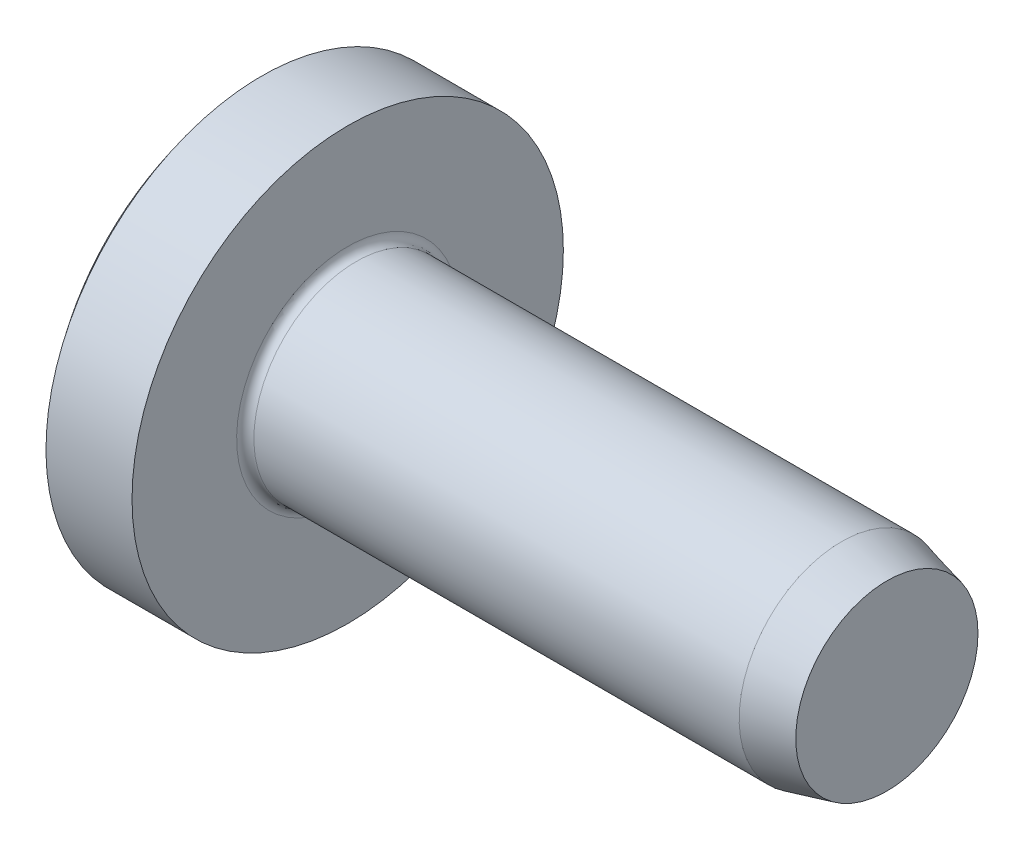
ISO-10303-21;
HEADER;
FILE_DESCRIPTION(('STEP AP214'),'2;1');
FILE_NAME('part.step','',(''),(''),'','','');
FILE_SCHEMA(('AUTOMOTIVE_DESIGN { 1 0 10303 214 1 1 1 1 }'));
ENDSEC;
DATA;
#1=APPLICATION_CONTEXT('core data for automotive mechanical design processes');
#2=APPLICATION_PROTOCOL_DEFINITION('international standard','automotive_design',2000,#1);
#3=PRODUCT_CONTEXT('',#1,'mechanical');
#4=PRODUCT('Part','Part','',(#3));
#5=PRODUCT_RELATED_PRODUCT_CATEGORY('part','',(#4));
#6=PRODUCT_DEFINITION_FORMATION('','',#4);
#7=PRODUCT_DEFINITION_CONTEXT('part definition',#1,'design');
#8=PRODUCT_DEFINITION('design','',#6,#7);
#9=PRODUCT_DEFINITION_SHAPE('','',#8);
#10=(LENGTH_UNIT() NAMED_UNIT(*) SI_UNIT(.MILLI.,.METRE.));
#11=(NAMED_UNIT(*) PLANE_ANGLE_UNIT() SI_UNIT($,.RADIAN.));
#12=(NAMED_UNIT(*) SI_UNIT($,.STERADIAN.) SOLID_ANGLE_UNIT());
#13=UNCERTAINTY_MEASURE_WITH_UNIT(LENGTH_MEASURE(1.E-05),#10,'distance_accuracy_value','');
#14=(GEOMETRIC_REPRESENTATION_CONTEXT(3) GLOBAL_UNCERTAINTY_ASSIGNED_CONTEXT((#13)) GLOBAL_UNIT_ASSIGNED_CONTEXT((#10,
#11,#12)) REPRESENTATION_CONTEXT('',''));
#15=CARTESIAN_POINT('',(0.,0.,0.));
#16=DIRECTION('',(0.,0.,1.));
#17=DIRECTION('',(1.,0.,0.));
#18=AXIS2_PLACEMENT_3D('',#15,#16,#17);
#19=CARTESIAN_POINT('',(-65.5475361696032,0.,0.));
#20=DIRECTION('',(-1.,0.,0.));
#21=DIRECTION('',(0.,-1.,0.));
#22=AXIS2_PLACEMENT_3D('',#19,#20,#21);
#23=CYLINDRICAL_SURFACE('',#22,4.75000000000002);
#24=CARTESIAN_POINT('',(30.4,0.,0.));
#25=DIRECTION('',(1.,0.,0.));
#26=DIRECTION('',(0.,0.,-1.));
#27=AXIS2_PLACEMENT_3D('',#24,#25,#26);
#28=CIRCLE('',#27,4.75);
#29=CARTESIAN_POINT('',(30.4,0.,-4.75));
#30=VERTEX_POINT('',#29);
#31=EDGE_CURVE('E252',#30,#30,#28,.T.);
#32=ORIENTED_EDGE('',*,*,#31,.F.);
#33=EDGE_LOOP('',(#32));
#34=FACE_BOUND('',#33,.T.);
#35=CARTESIAN_POINT('',(7.9,0.,0.));
#36=DIRECTION('',(-1.,0.,0.));
#37=DIRECTION('',(0.,-1.,0.));
#38=AXIS2_PLACEMENT_3D('',#35,#36,#37);
#39=CIRCLE('',#38,4.75000000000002);
#40=CARTESIAN_POINT('',(7.9,-4.75000000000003,0.));
#41=VERTEX_POINT('',#40);
#42=EDGE_CURVE('E12',#41,#41,#39,.F.);
#43=ORIENTED_EDGE('',*,*,#42,.T.);
#44=EDGE_LOOP('',(#43));
#45=FACE_BOUND('',#44,.T.);
#46=ADVANCED_FACE('F38',(#34,#45),#23,.T.);
#47=CARTESIAN_POINT('',(16.,0.,0.));
#48=DIRECTION('',(-1.,0.,0.));
#49=DIRECTION('',(0.,1.,0.));
#50=AXIS2_PLACEMENT_3D('',#47,#48,#49);
#51=SPHERICAL_SURFACE('',#50,16.);
#52=CARTESIAN_POINT('',(3.51000400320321,0.,0.));
#53=DIRECTION('',(-1.,0.,0.));
#54=DIRECTION('',(0.,-1.,0.));
#55=AXIS2_PLACEMENT_3D('',#52,#53,#54);
#56=CIRCLE('',#55,10.);
#57=CARTESIAN_POINT('',(3.51000400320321,-10.,0.));
#58=VERTEX_POINT('',#57);
#59=EDGE_CURVE('E208',#58,#58,#56,.T.);
#60=ORIENTED_EDGE('',*,*,#59,.T.);
#61=EDGE_LOOP('',(#60));
#62=FACE_BOUND('',#61,.T.);
#63=CARTESIAN_POINT('',(16.,0.,-1.01));
#64=DIRECTION('',(0.,0.,1.));
#65=DIRECTION('',(0.,-1.,0.));
#66=AXIS2_PLACEMENT_3D('',#63,#64,#65);
#67=CIRCLE('',#66,15.9680900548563);
#68=CARTESIAN_POINT('',(0.71931245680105,4.63470475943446,-1.01));
#69=VERTEX_POINT('',#68);
#70=CARTESIAN_POINT('',(0.0638837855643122,1.01,-1.01));
#71=VERTEX_POINT('',#70);
#72=EDGE_CURVE('E167',#69,#71,#67,.T.);
#73=ORIENTED_EDGE('',*,*,#72,.F.);
#74=CARTESIAN_POINT('',(14.1867141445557,-3.14070323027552,0.));
#75=DIRECTION('',(-0.500000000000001,-0.866025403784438,0.));
#76=DIRECTION('',(0.866025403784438,-0.500000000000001,0.));
#77=AXIS2_PLACEMENT_3D('',#74,#75,#76);
#78=CIRCLE('',#77,15.5835803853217);
#79=CARTESIAN_POINT('',(0.71931245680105,4.63470475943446,1.01));
#80=VERTEX_POINT('',#79);
#81=EDGE_CURVE('E197',#80,#69,#78,.T.);
#82=ORIENTED_EDGE('',*,*,#81,.F.);
#83=CARTESIAN_POINT('',(16.,0.,1.01));
#84=DIRECTION('',(0.,0.,-1.));
#85=DIRECTION('',(0.,1.,0.));
#86=AXIS2_PLACEMENT_3D('',#83,#84,#85);
#87=CIRCLE('',#86,15.9680900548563);
#88=CARTESIAN_POINT('',(0.0638837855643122,1.01,1.01));
#89=VERTEX_POINT('',#88);
#90=EDGE_CURVE('E171',#89,#80,#87,.T.);
#91=ORIENTED_EDGE('',*,*,#90,.F.);
#92=CARTESIAN_POINT('',(16.,1.01,0.));
#93=DIRECTION('',(0.,-1.,0.));
#94=DIRECTION('',(0.,0.,-1.));
#95=AXIS2_PLACEMENT_3D('',#92,#93,#94);
#96=CIRCLE('',#95,15.9680900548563);
#97=CARTESIAN_POINT('',(0.71931245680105,1.01,4.63470475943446));
#98=VERTEX_POINT('',#97);
#99=EDGE_CURVE('E163',#98,#89,#96,.T.);
#100=ORIENTED_EDGE('',*,*,#99,.F.);
#101=CARTESIAN_POINT('',(14.1867141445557,0.,-3.14070323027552));
#102=DIRECTION('',(-0.500000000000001,0.,-0.866025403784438));
#103=DIRECTION('',(-0.866025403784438,0.,0.500000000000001));
#104=AXIS2_PLACEMENT_3D('',#101,#102,#103);
#105=CIRCLE('',#104,15.5835803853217);
#106=CARTESIAN_POINT('',(0.71931245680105,-1.01,4.63470475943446));
#107=VERTEX_POINT('',#106);
#108=EDGE_CURVE('E161',#107,#98,#105,.T.);
#109=ORIENTED_EDGE('',*,*,#108,.F.);
#110=CARTESIAN_POINT('',(16.,-1.01,0.));
#111=DIRECTION('',(0.,1.,0.));
#112=DIRECTION('',(0.,0.,1.));
#113=AXIS2_PLACEMENT_3D('',#110,#111,#112);
#114=CIRCLE('',#113,15.9680900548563);
#115=CARTESIAN_POINT('',(0.0638837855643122,-1.01,1.01));
#116=VERTEX_POINT('',#115);
#117=EDGE_CURVE('E145',#116,#107,#114,.T.);
#118=ORIENTED_EDGE('',*,*,#117,.F.);
#119=CARTESIAN_POINT('',(16.,0.,1.01));
#120=DIRECTION('',(0.,0.,-1.));
#121=DIRECTION('',(0.,1.,0.));
#122=AXIS2_PLACEMENT_3D('',#119,#120,#121);
#123=CIRCLE('',#122,15.9680900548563);
#124=CARTESIAN_POINT('',(0.71931245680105,-4.63470475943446,1.01));
#125=VERTEX_POINT('',#124);
#126=EDGE_CURVE('E135',#125,#116,#123,.T.);
#127=ORIENTED_EDGE('',*,*,#126,.F.);
#128=CARTESIAN_POINT('',(14.1867141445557,3.14070323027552,0.));
#129=DIRECTION('',(-0.500000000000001,0.866025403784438,0.));
#130=DIRECTION('',(-0.866025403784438,-0.500000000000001,0.));
#131=AXIS2_PLACEMENT_3D('',#128,#129,#130);
#132=CIRCLE('',#131,15.5835803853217);
#133=CARTESIAN_POINT('',(0.71931245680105,-4.63470475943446,-1.01));
#134=VERTEX_POINT('',#133);
#135=EDGE_CURVE('E146',#134,#125,#132,.T.);
#136=ORIENTED_EDGE('',*,*,#135,.F.);
#137=CARTESIAN_POINT('',(16.,0.,-1.01));
#138=DIRECTION('',(0.,0.,1.));
#139=DIRECTION('',(0.,-1.,0.));
#140=AXIS2_PLACEMENT_3D('',#137,#138,#139);
#141=CIRCLE('',#140,15.9680900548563);
#142=CARTESIAN_POINT('',(0.0638837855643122,-1.01,-1.01));
#143=VERTEX_POINT('',#142);
#144=EDGE_CURVE('E173',#143,#134,#141,.T.);
#145=ORIENTED_EDGE('',*,*,#144,.F.);
#146=CARTESIAN_POINT('',(16.,-1.01,0.));
#147=DIRECTION('',(0.,1.,0.));
#148=DIRECTION('',(0.,0.,1.));
#149=AXIS2_PLACEMENT_3D('',#146,#147,#148);
#150=CIRCLE('',#149,15.9680900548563);
#151=CARTESIAN_POINT('',(0.71931245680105,-1.01,-4.63470475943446));
#152=VERTEX_POINT('',#151);
#153=EDGE_CURVE('E185',#152,#143,#150,.T.);
#154=ORIENTED_EDGE('',*,*,#153,.F.);
#155=CARTESIAN_POINT('',(14.1867141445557,0.,3.14070323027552));
#156=DIRECTION('',(-0.500000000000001,0.,0.866025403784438));
#157=DIRECTION('',(0.866025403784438,0.,0.500000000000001));
#158=AXIS2_PLACEMENT_3D('',#155,#156,#157);
#159=CIRCLE('',#158,15.5835803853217);
#160=CARTESIAN_POINT('',(0.71931245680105,1.01,-4.63470475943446));
#161=VERTEX_POINT('',#160);
#162=EDGE_CURVE('E183',#161,#152,#159,.T.);
#163=ORIENTED_EDGE('',*,*,#162,.F.);
#164=CARTESIAN_POINT('',(16.,1.01,0.));
#165=DIRECTION('',(0.,-1.,0.));
#166=DIRECTION('',(0.,0.,-1.));
#167=AXIS2_PLACEMENT_3D('',#164,#165,#166);
#168=CIRCLE('',#167,15.9680900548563);
#169=EDGE_CURVE('E186',#71,#161,#168,.T.);
#170=ORIENTED_EDGE('',*,*,#169,.F.);
#171=EDGE_LOOP('',(#73,#82,#91,#100,#109,#118,#127,#136,#145,#154,#163,#170));
#172=FACE_BOUND('',#171,.T.);
#173=ADVANCED_FACE('F158',(#62,#172),#51,.T.);
#174=CARTESIAN_POINT('',(7.5,4.75,0.));
#175=DIRECTION('',(-1.,0.,0.));
#176=DIRECTION('',(0.,-1.,0.));
#177=AXIS2_PLACEMENT_3D('',#174,#175,#176);
#178=PLANE('',#177);
#179=CARTESIAN_POINT('',(7.5,0.,0.));
#180=DIRECTION('',(-1.,0.,0.));
#181=DIRECTION('',(0.,-1.,0.));
#182=AXIS2_PLACEMENT_3D('',#179,#180,#181);
#183=CIRCLE('',#182,5.15000000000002);
#184=CARTESIAN_POINT('',(7.5,-5.15000000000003,0.));
#185=VERTEX_POINT('',#184);
#186=EDGE_CURVE('E48',#185,#185,#183,.T.);
#187=ORIENTED_EDGE('',*,*,#186,.T.);
#188=EDGE_LOOP('',(#187));
#189=FACE_BOUND('',#188,.T.);
#190=CARTESIAN_POINT('',(7.49999999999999,0.,0.));
#191=DIRECTION('',(-1.,0.,0.));
#192=DIRECTION('',(0.,-1.,0.));
#193=AXIS2_PLACEMENT_3D('',#190,#191,#192);
#194=CIRCLE('',#193,10.);
#195=CARTESIAN_POINT('',(7.49999999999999,-10.,0.));
#196=VERTEX_POINT('',#195);
#197=EDGE_CURVE('E228',#196,#196,#194,.T.);
#198=ORIENTED_EDGE('',*,*,#197,.F.);
#199=EDGE_LOOP('',(#198));
#200=FACE_BOUND('',#199,.T.);
#201=ADVANCED_FACE('F273',(#189,#200),#178,.F.);
#202=CARTESIAN_POINT('',(-65.5475361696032,0.,0.));
#203=DIRECTION('',(-1.,0.,0.));
#204=DIRECTION('',(0.,-1.,0.));
#205=AXIS2_PLACEMENT_3D('',#202,#203,#204);
#206=CYLINDRICAL_SURFACE('',#205,10.);
#207=ORIENTED_EDGE('',*,*,#59,.F.);
#208=EDGE_LOOP('',(#207));
#209=FACE_BOUND('',#208,.T.);
#210=ORIENTED_EDGE('',*,*,#197,.T.);
#211=EDGE_LOOP('',(#210));
#212=FACE_BOUND('',#211,.T.);
#213=ADVANCED_FACE('F276',(#209,#212),#206,.T.);
#214=CARTESIAN_POINT('',(5.2,5.05,-1.01));
#215=DIRECTION('',(0.,0.,1.));
#216=DIRECTION('',(0.,-1.,0.));
#217=AXIS2_PLACEMENT_3D('',#214,#215,#216);
#218=PLANE('',#217);
#219=ORIENTED_EDGE('',*,*,#72,.T.);
#220=DIRECTION('',(-1.,0.,0.));
#221=VECTOR('',#220,1.);
#222=CARTESIAN_POINT('',(5.2,1.01,-1.01));
#223=LINE('',#222,#221);
#224=CARTESIAN_POINT('',(5.2,1.01,-1.01));
#225=VERTEX_POINT('',#224);
#226=EDGE_CURVE('E57',#225,#71,#223,.T.);
#227=ORIENTED_EDGE('',*,*,#226,.F.);
#228=DIRECTION('',(0.,1.,0.));
#229=VECTOR('',#228,1.);
#230=CARTESIAN_POINT('',(5.2,5.05,-1.01));
#231=LINE('',#230,#229);
#232=CARTESIAN_POINT('',(5.2,2.04777860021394,-1.01));
#233=VERTEX_POINT('',#232);
#234=EDGE_CURVE('E206',#225,#233,#231,.T.);
#235=ORIENTED_EDGE('',*,*,#234,.T.);
#236=DIRECTION('',(-0.866025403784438,0.500000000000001,0.));
#237=VECTOR('',#236,1.);
#238=CARTESIAN_POINT('',(0.,5.05,-1.01));
#239=LINE('',#238,#237);
#240=EDGE_CURVE('E202',#233,#69,#239,.T.);
#241=ORIENTED_EDGE('',*,*,#240,.T.);
#242=EDGE_LOOP('',(#219,#227,#235,#241));
#243=FACE_BOUND('',#242,.T.);
#244=ADVANCED_FACE('F245',(#243),#218,.T.);
#245=CARTESIAN_POINT('',(0.,5.05,0.));
#246=DIRECTION('',(-0.500000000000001,-0.866025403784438,0.));
#247=DIRECTION('',(0.866025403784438,-0.500000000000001,0.));
#248=AXIS2_PLACEMENT_3D('',#245,#246,#247);
#249=PLANE('',#248);
#250=ORIENTED_EDGE('',*,*,#81,.T.);
#251=ORIENTED_EDGE('',*,*,#240,.F.);
#252=DIRECTION('',(0.,0.,1.));
#253=VECTOR('',#252,1.);
#254=CARTESIAN_POINT('',(5.2,2.04777860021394,0.));
#255=LINE('',#254,#253);
#256=CARTESIAN_POINT('',(5.2,2.04777860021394,1.01));
#257=VERTEX_POINT('',#256);
#258=EDGE_CURVE('E204',#233,#257,#255,.T.);
#259=ORIENTED_EDGE('',*,*,#258,.T.);
#260=DIRECTION('',(-0.866025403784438,0.500000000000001,0.));
#261=VECTOR('',#260,1.);
#262=CARTESIAN_POINT('',(3.89999999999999,2.79833395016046,1.01));
#263=LINE('',#262,#261);
#264=EDGE_CURVE('E199',#257,#80,#263,.T.);
#265=ORIENTED_EDGE('',*,*,#264,.T.);
#266=EDGE_LOOP('',(#250,#251,#259,#265));
#267=FACE_BOUND('',#266,.T.);
#268=ADVANCED_FACE('F240',(#267),#249,.T.);
#269=CARTESIAN_POINT('',(5.2,5.05,1.01));
#270=DIRECTION('',(0.,0.,-1.));
#271=DIRECTION('',(0.,1.,0.));
#272=AXIS2_PLACEMENT_3D('',#269,#270,#271);
#273=PLANE('',#272);
#274=ORIENTED_EDGE('',*,*,#90,.T.);
#275=ORIENTED_EDGE('',*,*,#264,.F.);
#276=DIRECTION('',(0.,-1.,0.));
#277=VECTOR('',#276,1.);
#278=CARTESIAN_POINT('',(5.2,5.05,1.01));
#279=LINE('',#278,#277);
#280=CARTESIAN_POINT('',(5.2,1.01,1.01));
#281=VERTEX_POINT('',#280);
#282=EDGE_CURVE('E122',#257,#281,#279,.T.);
#283=ORIENTED_EDGE('',*,*,#282,.T.);
#284=DIRECTION('',(-1.,0.,0.));
#285=VECTOR('',#284,1.);
#286=CARTESIAN_POINT('',(5.2,1.01,1.01));
#287=LINE('',#286,#285);
#288=EDGE_CURVE('E203',#281,#89,#287,.T.);
#289=ORIENTED_EDGE('',*,*,#288,.T.);
#290=EDGE_LOOP('',(#274,#275,#283,#289));
#291=FACE_BOUND('',#290,.T.);
#292=ADVANCED_FACE('F237',(#291),#273,.T.);
#293=CARTESIAN_POINT('',(5.2,1.01,1.01));
#294=DIRECTION('',(0.,-1.,0.));
#295=DIRECTION('',(0.,0.,-1.));
#296=AXIS2_PLACEMENT_3D('',#293,#294,#295);
#297=PLANE('',#296);
#298=ORIENTED_EDGE('',*,*,#99,.T.);
#299=ORIENTED_EDGE('',*,*,#288,.F.);
#300=DIRECTION('',(0.,0.,1.));
#301=VECTOR('',#300,1.);
#302=CARTESIAN_POINT('',(5.2,1.01,1.01));
#303=LINE('',#302,#301);
#304=CARTESIAN_POINT('',(5.2,1.01,2.04777860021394));
#305=VERTEX_POINT('',#304);
#306=EDGE_CURVE('E114',#281,#305,#303,.T.);
#307=ORIENTED_EDGE('',*,*,#306,.T.);
#308=DIRECTION('',(-0.866025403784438,0.,0.500000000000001));
#309=VECTOR('',#308,1.);
#310=CARTESIAN_POINT('',(0.,1.01,5.05));
#311=LINE('',#310,#309);
#312=EDGE_CURVE('E42',#305,#98,#311,.T.);
#313=ORIENTED_EDGE('',*,*,#312,.T.);
#314=EDGE_LOOP('',(#298,#299,#307,#313));
#315=FACE_BOUND('',#314,.T.);
#316=ADVANCED_FACE('F301',(#315),#297,.T.);
#317=CARTESIAN_POINT('',(0.,0.,5.05));
#318=DIRECTION('',(-0.500000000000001,0.,-0.866025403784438));
#319=DIRECTION('',(-0.866025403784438,0.,0.500000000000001));
#320=AXIS2_PLACEMENT_3D('',#317,#318,#319);
#321=PLANE('',#320);
#322=ORIENTED_EDGE('',*,*,#108,.T.);
#323=ORIENTED_EDGE('',*,*,#312,.F.);
#324=DIRECTION('',(0.,-1.,0.));
#325=VECTOR('',#324,1.);
#326=CARTESIAN_POINT('',(5.2,0.,2.04777860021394));
#327=LINE('',#326,#325);
#328=CARTESIAN_POINT('',(5.2,-1.01,2.04777860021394));
#329=VERTEX_POINT('',#328);
#330=EDGE_CURVE('E210',#305,#329,#327,.T.);
#331=ORIENTED_EDGE('',*,*,#330,.T.);
#332=DIRECTION('',(-0.866025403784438,0.,0.500000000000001));
#333=VECTOR('',#332,1.);
#334=CARTESIAN_POINT('',(5.64937131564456,-1.01,1.78833395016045));
#335=LINE('',#334,#333);
#336=EDGE_CURVE('E154',#329,#107,#335,.T.);
#337=ORIENTED_EDGE('',*,*,#336,.T.);
#338=EDGE_LOOP('',(#322,#323,#331,#337));
#339=FACE_BOUND('',#338,.T.);
#340=ADVANCED_FACE('F299',(#339),#321,.T.);
#341=CARTESIAN_POINT('',(5.2,-1.01,1.01));
#342=DIRECTION('',(0.,1.,0.));
#343=DIRECTION('',(0.,0.,1.));
#344=AXIS2_PLACEMENT_3D('',#341,#342,#343);
#345=PLANE('',#344);
#346=ORIENTED_EDGE('',*,*,#117,.T.);
#347=ORIENTED_EDGE('',*,*,#336,.F.);
#348=DIRECTION('',(0.,0.,-1.));
#349=VECTOR('',#348,1.);
#350=CARTESIAN_POINT('',(5.2,-1.01,1.01));
#351=LINE('',#350,#349);
#352=CARTESIAN_POINT('',(5.2,-1.01,1.01));
#353=VERTEX_POINT('',#352);
#354=EDGE_CURVE('E153',#329,#353,#351,.T.);
#355=ORIENTED_EDGE('',*,*,#354,.T.);
#356=DIRECTION('',(-1.,0.,0.));
#357=VECTOR('',#356,1.);
#358=CARTESIAN_POINT('',(5.2,-1.01,1.01));
#359=LINE('',#358,#357);
#360=EDGE_CURVE('E138',#353,#116,#359,.T.);
#361=ORIENTED_EDGE('',*,*,#360,.T.);
#362=EDGE_LOOP('',(#346,#347,#355,#361));
#363=FACE_BOUND('',#362,.T.);
#364=ADVANCED_FACE('F149',(#363),#345,.T.);
#365=CARTESIAN_POINT('',(5.2,-5.05,1.01));
#366=DIRECTION('',(0.,0.,-1.));
#367=DIRECTION('',(0.,1.,0.));
#368=AXIS2_PLACEMENT_3D('',#365,#366,#367);
#369=PLANE('',#368);
#370=ORIENTED_EDGE('',*,*,#126,.T.);
#371=ORIENTED_EDGE('',*,*,#360,.F.);
#372=DIRECTION('',(0.,-1.,0.));
#373=VECTOR('',#372,1.);
#374=CARTESIAN_POINT('',(5.2,-5.05,1.01));
#375=LINE('',#374,#373);
#376=CARTESIAN_POINT('',(5.2,-2.04777860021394,1.01));
#377=VERTEX_POINT('',#376);
#378=EDGE_CURVE('E181',#353,#377,#375,.T.);
#379=ORIENTED_EDGE('',*,*,#378,.T.);
#380=DIRECTION('',(-0.866025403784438,-0.500000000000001,0.));
#381=VECTOR('',#380,1.);
#382=CARTESIAN_POINT('',(0.,-5.05,1.01));
#383=LINE('',#382,#381);
#384=EDGE_CURVE('E141',#377,#125,#383,.T.);
#385=ORIENTED_EDGE('',*,*,#384,.T.);
#386=EDGE_LOOP('',(#370,#371,#379,#385));
#387=FACE_BOUND('',#386,.T.);
#388=ADVANCED_FACE('F137',(#387),#369,.T.);
#389=CARTESIAN_POINT('',(0.,-5.05,0.));
#390=DIRECTION('',(-0.500000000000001,0.866025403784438,0.));
#391=DIRECTION('',(-0.866025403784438,-0.500000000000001,0.));
#392=AXIS2_PLACEMENT_3D('',#389,#390,#391);
#393=PLANE('',#392);
#394=ORIENTED_EDGE('',*,*,#135,.T.);
#395=ORIENTED_EDGE('',*,*,#384,.F.);
#396=DIRECTION('',(0.,0.,-1.));
#397=VECTOR('',#396,1.);
#398=CARTESIAN_POINT('',(5.2,-2.04777860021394,0.));
#399=LINE('',#398,#397);
#400=CARTESIAN_POINT('',(5.2,-2.04777860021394,-1.01));
#401=VERTEX_POINT('',#400);
#402=EDGE_CURVE('E178',#377,#401,#399,.T.);
#403=ORIENTED_EDGE('',*,*,#402,.T.);
#404=DIRECTION('',(-0.866025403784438,-0.500000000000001,0.));
#405=VECTOR('',#404,1.);
#406=CARTESIAN_POINT('',(3.89999999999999,-2.79833395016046,-1.01));
#407=LINE('',#406,#405);
#408=EDGE_CURVE('E174',#401,#134,#407,.T.);
#409=ORIENTED_EDGE('',*,*,#408,.T.);
#410=EDGE_LOOP('',(#394,#395,#403,#409));
#411=FACE_BOUND('',#410,.T.);
#412=ADVANCED_FACE('F294',(#411),#393,.T.);
#413=CARTESIAN_POINT('',(5.2,-5.05,-1.01));
#414=DIRECTION('',(0.,0.,1.));
#415=DIRECTION('',(0.,-1.,0.));
#416=AXIS2_PLACEMENT_3D('',#413,#414,#415);
#417=PLANE('',#416);
#418=ORIENTED_EDGE('',*,*,#144,.T.);
#419=ORIENTED_EDGE('',*,*,#408,.F.);
#420=DIRECTION('',(0.,1.,0.));
#421=VECTOR('',#420,1.);
#422=CARTESIAN_POINT('',(5.2,-5.05,-1.01));
#423=LINE('',#422,#421);
#424=CARTESIAN_POINT('',(5.2,-1.01,-1.01));
#425=VERTEX_POINT('',#424);
#426=EDGE_CURVE('E180',#401,#425,#423,.T.);
#427=ORIENTED_EDGE('',*,*,#426,.T.);
#428=DIRECTION('',(-1.,0.,0.));
#429=VECTOR('',#428,1.);
#430=CARTESIAN_POINT('',(5.2,-1.01,-1.01));
#431=LINE('',#430,#429);
#432=EDGE_CURVE('E177',#425,#143,#431,.T.);
#433=ORIENTED_EDGE('',*,*,#432,.T.);
#434=EDGE_LOOP('',(#418,#419,#427,#433));
#435=FACE_BOUND('',#434,.T.);
#436=ADVANCED_FACE('F297',(#435),#417,.T.);
#437=CARTESIAN_POINT('',(5.2,-1.01,-1.01));
#438=DIRECTION('',(0.,1.,0.));
#439=DIRECTION('',(0.,0.,1.));
#440=AXIS2_PLACEMENT_3D('',#437,#438,#439);
#441=PLANE('',#440);
#442=ORIENTED_EDGE('',*,*,#153,.T.);
#443=ORIENTED_EDGE('',*,*,#432,.F.);
#444=DIRECTION('',(0.,0.,-1.));
#445=VECTOR('',#444,1.);
#446=CARTESIAN_POINT('',(5.2,-1.01,-1.01));
#447=LINE('',#446,#445);
#448=CARTESIAN_POINT('',(5.2,-1.01,-2.04777860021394));
#449=VERTEX_POINT('',#448);
#450=EDGE_CURVE('E194',#425,#449,#447,.T.);
#451=ORIENTED_EDGE('',*,*,#450,.T.);
#452=DIRECTION('',(-0.866025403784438,0.,-0.500000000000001));
#453=VECTOR('',#452,1.);
#454=CARTESIAN_POINT('',(0.,-1.01,-5.05));
#455=LINE('',#454,#453);
#456=EDGE_CURVE('E190',#449,#152,#455,.T.);
#457=ORIENTED_EDGE('',*,*,#456,.T.);
#458=EDGE_LOOP('',(#442,#443,#451,#457));
#459=FACE_BOUND('',#458,.T.);
#460=ADVANCED_FACE('F318',(#459),#441,.T.);
#461=CARTESIAN_POINT('',(0.,0.,-5.05));
#462=DIRECTION('',(-0.500000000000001,0.,0.866025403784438));
#463=DIRECTION('',(0.866025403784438,0.,0.500000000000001));
#464=AXIS2_PLACEMENT_3D('',#461,#462,#463);
#465=PLANE('',#464);
#466=ORIENTED_EDGE('',*,*,#162,.T.);
#467=ORIENTED_EDGE('',*,*,#456,.F.);
#468=DIRECTION('',(0.,1.,0.));
#469=VECTOR('',#468,1.);
#470=CARTESIAN_POINT('',(5.2,0.,-2.04777860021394));
#471=LINE('',#470,#469);
#472=CARTESIAN_POINT('',(5.2,1.01,-2.04777860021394));
#473=VERTEX_POINT('',#472);
#474=EDGE_CURVE('E191',#449,#473,#471,.T.);
#475=ORIENTED_EDGE('',*,*,#474,.T.);
#476=DIRECTION('',(-0.866025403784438,0.,-0.500000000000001));
#477=VECTOR('',#476,1.);
#478=CARTESIAN_POINT('',(5.64937131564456,1.01,-1.78833395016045));
#479=LINE('',#478,#477);
#480=EDGE_CURVE('E187',#473,#161,#479,.T.);
#481=ORIENTED_EDGE('',*,*,#480,.T.);
#482=EDGE_LOOP('',(#466,#467,#475,#481));
#483=FACE_BOUND('',#482,.T.);
#484=ADVANCED_FACE('F40',(#483),#465,.T.);
#485=CARTESIAN_POINT('',(5.2,1.01,-1.01));
#486=DIRECTION('',(0.,-1.,0.));
#487=DIRECTION('',(0.,0.,-1.));
#488=AXIS2_PLACEMENT_3D('',#485,#486,#487);
#489=PLANE('',#488);
#490=ORIENTED_EDGE('',*,*,#169,.T.);
#491=ORIENTED_EDGE('',*,*,#480,.F.);
#492=DIRECTION('',(0.,0.,1.));
#493=VECTOR('',#492,1.);
#494=CARTESIAN_POINT('',(5.2,1.01,-1.01));
#495=LINE('',#494,#493);
#496=EDGE_CURVE('E193',#473,#225,#495,.T.);
#497=ORIENTED_EDGE('',*,*,#496,.T.);
#498=ORIENTED_EDGE('',*,*,#226,.T.);
#499=EDGE_LOOP('',(#490,#491,#497,#498));
#500=FACE_BOUND('',#499,.T.);
#501=ADVANCED_FACE('F323',(#500),#489,.T.);
#502=CARTESIAN_POINT('',(5.2,-1.01,-1.01));
#503=DIRECTION('',(1.,0.,0.));
#504=DIRECTION('',(0.,0.,-1.));
#505=AXIS2_PLACEMENT_3D('',#502,#503,#504);
#506=PLANE('',#505);
#507=ORIENTED_EDGE('',*,*,#234,.F.);
#508=ORIENTED_EDGE('',*,*,#496,.F.);
#509=ORIENTED_EDGE('',*,*,#474,.F.);
#510=ORIENTED_EDGE('',*,*,#450,.F.);
#511=ORIENTED_EDGE('',*,*,#426,.F.);
#512=ORIENTED_EDGE('',*,*,#402,.F.);
#513=ORIENTED_EDGE('',*,*,#378,.F.);
#514=ORIENTED_EDGE('',*,*,#354,.F.);
#515=ORIENTED_EDGE('',*,*,#330,.F.);
#516=ORIENTED_EDGE('',*,*,#306,.F.);
#517=ORIENTED_EDGE('',*,*,#282,.F.);
#518=ORIENTED_EDGE('',*,*,#258,.F.);
#519=EDGE_LOOP('',(#507,#508,#509,#510,#511,#512,#513,#514,#515,#516,#517,#518));
#520=FACE_BOUND('',#519,.T.);
#521=ADVANCED_FACE('F269',(#520),#506,.F.);
#522=CARTESIAN_POINT('',(7.9,0.,0.));
#523=DIRECTION('',(-1.,0.,0.));
#524=DIRECTION('',(0.,-1.,0.));
#525=AXIS2_PLACEMENT_3D('',#522,#523,#524);
#526=TOROIDAL_SURFACE('',#525,5.15000000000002,0.4);
#527=ORIENTED_EDGE('',*,*,#42,.F.);
#528=EDGE_LOOP('',(#527));
#529=FACE_BOUND('',#528,.T.);
#530=ORIENTED_EDGE('',*,*,#186,.F.);
#531=EDGE_LOOP('',(#530));
#532=FACE_BOUND('',#531,.T.);
#533=ADVANCED_FACE('F266',(#529,#532),#526,.F.);
#534=CARTESIAN_POINT('',(32.5,0.,0.));
#535=DIRECTION('',(-1.,0.,0.));
#536=DIRECTION('',(0.,0.,1.));
#537=AXIS2_PLACEMENT_3D('',#534,#535,#536);
#538=CONICAL_SURFACE('',#537,4.225,0.244978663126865);
#539=ORIENTED_EDGE('',*,*,#31,.T.);
#540=EDGE_LOOP('',(#539));
#541=FACE_BOUND('',#540,.T.);
#542=CARTESIAN_POINT('',(32.5,0.,0.));
#543=DIRECTION('',(1.,0.,0.));
#544=DIRECTION('',(0.,0.,-1.));
#545=AXIS2_PLACEMENT_3D('',#542,#543,#544);
#546=CIRCLE('',#545,4.225);
#547=CARTESIAN_POINT('',(32.5,0.,-4.225));
#548=VERTEX_POINT('',#547);
#549=EDGE_CURVE('E250',#548,#548,#546,.T.);
#550=ORIENTED_EDGE('',*,*,#549,.F.);
#551=EDGE_LOOP('',(#550));
#552=FACE_BOUND('',#551,.T.);
#553=ADVANCED_FACE('F258',(#541,#552),#538,.T.);
#554=CARTESIAN_POINT('',(32.5,0.,0.));
#555=DIRECTION('',(-1.,0.,0.));
#556=DIRECTION('',(0.,-1.,0.));
#557=AXIS2_PLACEMENT_3D('',#554,#555,#556);
#558=PLANE('',#557);
#559=ORIENTED_EDGE('',*,*,#549,.T.);
#560=EDGE_LOOP('',(#559));
#561=FACE_BOUND('',#560,.T.);
#562=ADVANCED_FACE('F290',(#561),#558,.F.);
#563=CLOSED_SHELL('',(#46,#173,#201,#213,#244,#268,#292,#316,#340,#364,#388,#412,#436,#460,#484,
#501,#521,#533,#553,#562));
#564=MANIFOLD_SOLID_BREP('B2',#563);
#565=ADVANCED_BREP_SHAPE_REPRESENTATION('',(#18,#564),#14);
#566=SHAPE_DEFINITION_REPRESENTATION(#9,#565);
ENDSEC;
END-ISO-10303-21;
